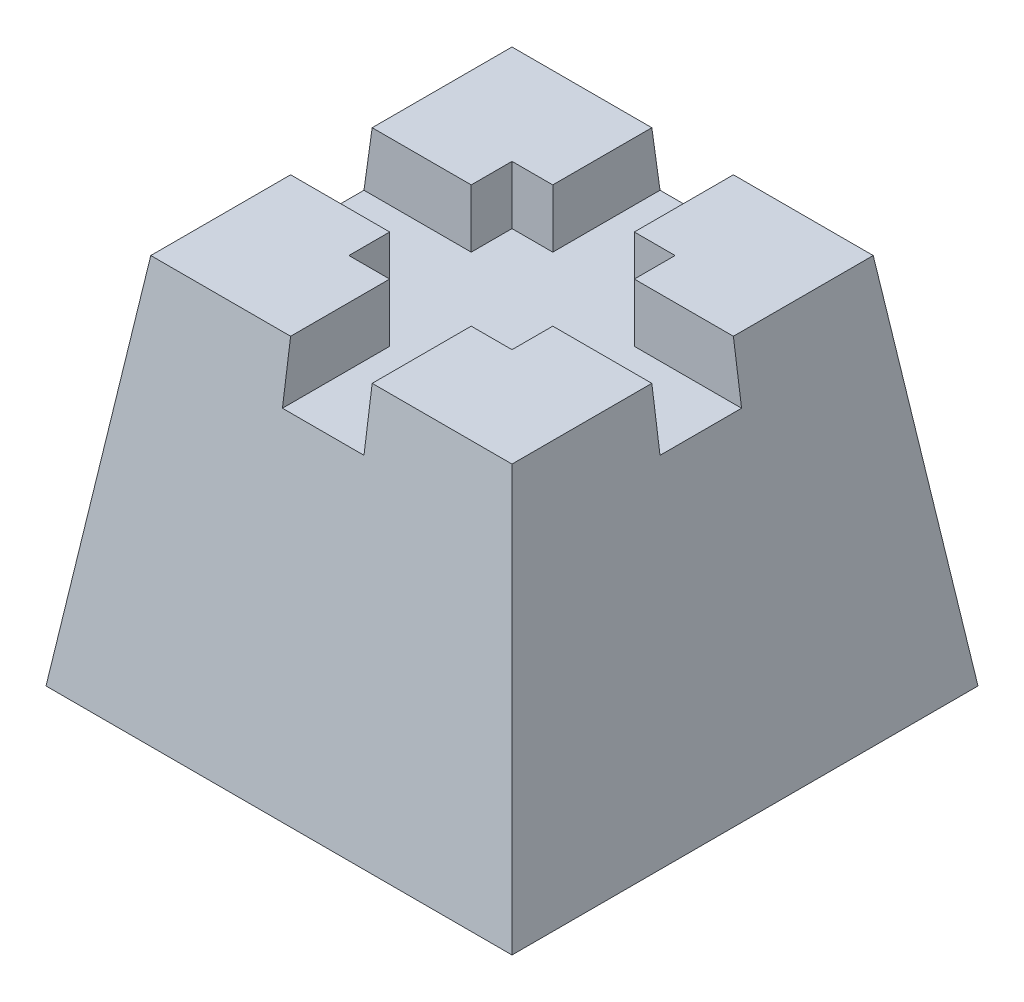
from build123d import *

# Parameters (mm, degrees)
SKETCH1_W          = 254
SKETCH1_H          = 254
EXTRUDE1_DEPTH     = 203.2
EXTRUDE1_TAPER     = 8
CUT_EXTRUDE1_DEPTH = 31.75
SKETCH3_W          = 88.9
SKETCH3_H          = 88.9
CUT_EXTRUDE2_DEPTH = 31.75


with BuildPart() as part:
    # Sketch1 → Extrude1 (new body)
    with BuildSketch(Plane(origin=(0, 0, 0), x_dir=(1, 0, 0), z_dir=(0, 1, 0))):
        Rectangle(SKETCH1_W, SKETCH1_H)
    extrude(amount=EXTRUDE1_DEPTH, taper=EXTRUDE1_TAPER)

    # Sketch2 → Cut-Extrude1 (cut)
    with BuildSketch(Plane(origin=(0, 203.2, 0), x_dir=(-1, 0, 0), z_dir=(0, 1, 0))):
        Polygon((22.225, -127), (-22.225, -127), (-22.225, -22.225), (-127, -22.225), (-127, 22.225), (-22.225, 22.225), (-22.225, 127), (22.225, 127), (22.225, 22.225), (127, 22.225), (127, -22.225), (22.225, -22.225), align=None)
    extrude(amount=-CUT_EXTRUDE1_DEPTH, mode=Mode.SUBTRACT)

    # Sketch3 → Cut-Extrude2 (cut)
    with BuildSketch(Plane(origin=(0, 203.2, 0), x_dir=(-1, 0, 0), z_dir=(0, 1, 0))):
        Rectangle(SKETCH3_W, SKETCH3_H)
    extrude(amount=-CUT_EXTRUDE2_DEPTH, mode=Mode.SUBTRACT)


solid = part.part
